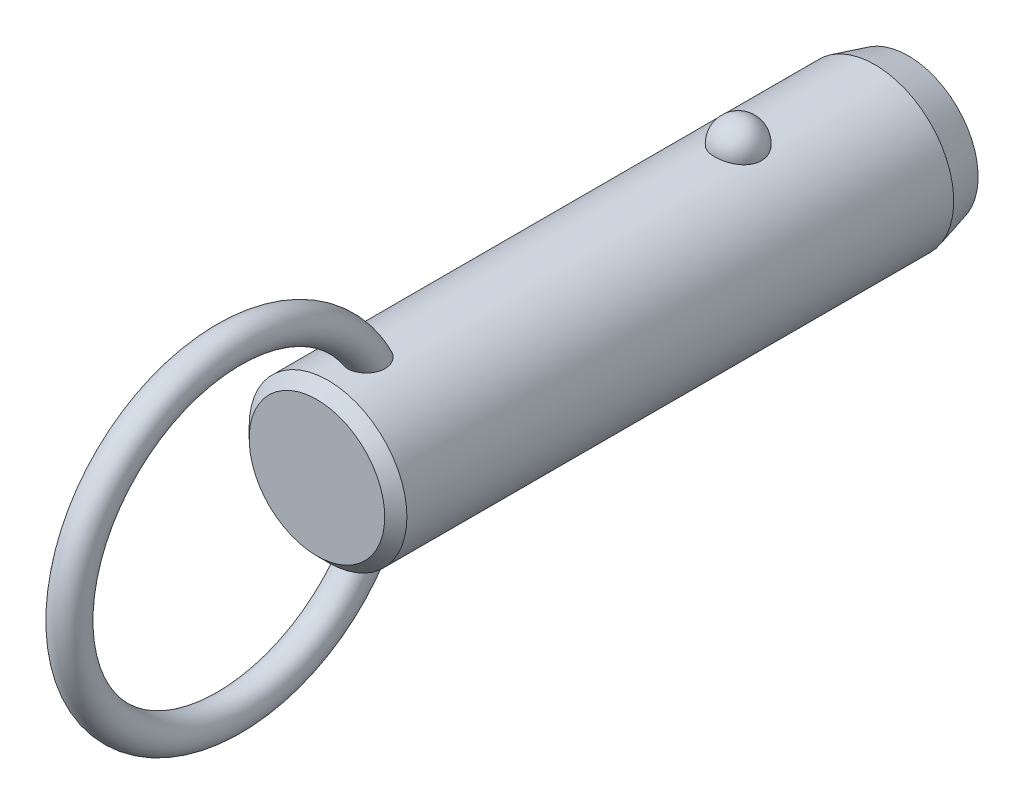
ISO-10303-21;
HEADER;
FILE_DESCRIPTION(('STEP AP214'),'2;1');
FILE_NAME('part.step','',(''),(''),'','','');
FILE_SCHEMA(('AUTOMOTIVE_DESIGN { 1 0 10303 214 1 1 1 1 }'));
ENDSEC;
DATA;
#1=APPLICATION_CONTEXT('core data for automotive mechanical design processes');
#2=APPLICATION_PROTOCOL_DEFINITION('international standard','automotive_design',2000,#1);
#3=PRODUCT_CONTEXT('',#1,'mechanical');
#4=PRODUCT('Part','Part','',(#3));
#5=PRODUCT_RELATED_PRODUCT_CATEGORY('part','',(#4));
#6=PRODUCT_DEFINITION_FORMATION('','',#4);
#7=PRODUCT_DEFINITION_CONTEXT('part definition',#1,'design');
#8=PRODUCT_DEFINITION('design','',#6,#7);
#9=PRODUCT_DEFINITION_SHAPE('','',#8);
#10=(LENGTH_UNIT() NAMED_UNIT(*) SI_UNIT(.MILLI.,.METRE.));
#11=(NAMED_UNIT(*) PLANE_ANGLE_UNIT() SI_UNIT($,.RADIAN.));
#12=(NAMED_UNIT(*) SI_UNIT($,.STERADIAN.) SOLID_ANGLE_UNIT());
#13=UNCERTAINTY_MEASURE_WITH_UNIT(LENGTH_MEASURE(1.E-05),#10,'distance_accuracy_value','');
#14=(GEOMETRIC_REPRESENTATION_CONTEXT(3) GLOBAL_UNCERTAINTY_ASSIGNED_CONTEXT((#13)) GLOBAL_UNIT_ASSIGNED_CONTEXT((#10,
#11,#12)) REPRESENTATION_CONTEXT('',''));
#15=CARTESIAN_POINT('',(0.,0.,0.));
#16=DIRECTION('',(0.,0.,1.));
#17=DIRECTION('',(1.,0.,0.));
#18=AXIS2_PLACEMENT_3D('',#15,#16,#17);
#19=CARTESIAN_POINT('',(0.,0.,27.9));
#20=DIRECTION('',(0.,0.,-1.));
#21=DIRECTION('',(-1.,0.,0.));
#22=AXIS2_PLACEMENT_3D('',#19,#20,#21);
#23=CYLINDRICAL_SURFACE('',#22,7.1);
#24=CARTESIAN_POINT('',(2.0769088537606,6.78943661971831,-2.1));
#25=CARTESIAN_POINT('',(2.07690739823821,6.78943796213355,-1.98268154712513));
#26=CARTESIAN_POINT('',(2.06738130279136,6.79237331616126,-1.86534506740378));
#27=CARTESIAN_POINT('',(2.0295040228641,6.8037853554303,-1.63400788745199));
#28=CARTESIAN_POINT('',(2.00114757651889,6.81226358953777,-1.52000812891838));
#29=CARTESIAN_POINT('',(1.92632025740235,6.83379798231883,-1.29863433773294));
#30=CARTESIAN_POINT('',(1.87985726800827,6.84685214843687,-1.19125744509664));
#31=CARTESIAN_POINT('',(1.76995205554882,6.87608091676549,-0.98604657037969));
#32=CARTESIAN_POINT('',(1.70650980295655,6.8922555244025,-0.88821260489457));
#33=CARTESIAN_POINT('',(1.5638119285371,6.92602930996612,-0.704242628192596));
#34=CARTESIAN_POINT('',(1.4844714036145,6.94363582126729,-0.618173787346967));
#35=CARTESIAN_POINT('',(1.31221746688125,6.97823658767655,-0.460740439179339));
#36=CARTESIAN_POINT('',(1.21930409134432,6.99523084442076,-0.389375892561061));
#37=CARTESIAN_POINT('',(1.02268781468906,7.02666176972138,-0.263547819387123));
#38=CARTESIAN_POINT('',(0.91902009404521,7.04110638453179,-0.209031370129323));
#39=CARTESIAN_POINT('',(0.703548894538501,7.06588726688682,-0.118163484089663));
#40=CARTESIAN_POINT('',(0.591746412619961,7.07622403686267,-0.0818098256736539));
#41=CARTESIAN_POINT('',(0.365557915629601,7.09147068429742,-0.0288711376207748));
#42=CARTESIAN_POINT('',(0.251267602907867,7.09648447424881,-0.0119070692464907));
#43=CARTESIAN_POINT('',(0.0213499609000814,7.10089837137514,0.00304925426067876));
#44=CARTESIAN_POINT('',(-0.0942772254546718,7.10029907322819,0.00104351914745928));
#45=CARTESIAN_POINT('',(-0.321651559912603,7.09360829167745,-0.0216931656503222));
#46=CARTESIAN_POINT('',(-0.433431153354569,7.08760388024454,-0.0421272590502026));
#47=CARTESIAN_POINT('',(-0.651862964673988,7.07086131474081,-0.100729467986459));
#48=CARTESIAN_POINT('',(-0.758515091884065,7.06012307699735,-0.138897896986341));
#49=CARTESIAN_POINT('',(-0.964449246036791,7.03496097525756,-0.232213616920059));
#50=CARTESIAN_POINT('',(-1.06368095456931,7.02051445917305,-0.287465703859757));
#51=CARTESIAN_POINT('',(-1.25145353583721,6.98948740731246,-0.413383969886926));
#52=CARTESIAN_POINT('',(-1.33999321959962,6.97290663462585,-0.48405186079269));
#53=CARTESIAN_POINT('',(-1.50591604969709,6.93898770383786,-0.640594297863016));
#54=CARTESIAN_POINT('',(-1.58302488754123,6.92164094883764,-0.726757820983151));
#55=CARTESIAN_POINT('',(-1.72189320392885,6.8884103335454,-0.91092752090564));
#56=CARTESIAN_POINT('',(-1.78365144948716,6.87252659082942,-1.008934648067));
#57=CARTESIAN_POINT('',(-1.89101272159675,6.84377189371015,-1.21549497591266));
#58=CARTESIAN_POINT('',(-1.93639553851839,6.83094274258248,-1.32416860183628));
#59=CARTESIAN_POINT('',(-2.00874275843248,6.81002070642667,-1.54791500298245));
#60=CARTESIAN_POINT('',(-2.03570774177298,6.80192767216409,-1.66298757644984));
#61=CARTESIAN_POINT('',(-2.07047276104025,6.7914266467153,-1.89571453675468));
#62=CARTESIAN_POINT('',(-2.07835878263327,6.78899315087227,-2.01335491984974));
#63=CARTESIAN_POINT('',(-2.07502083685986,6.79001409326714,-2.24833570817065));
#64=CARTESIAN_POINT('',(-2.06379746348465,6.7934683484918,-2.36567612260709));
#65=CARTESIAN_POINT('',(-2.02263913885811,6.80583442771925,-2.59603194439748));
#66=CARTESIAN_POINT('',(-1.99281127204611,6.81471501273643,-2.70906820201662));
#67=CARTESIAN_POINT('',(-1.91526639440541,6.83691232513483,-2.92836575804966));
#68=CARTESIAN_POINT('',(-1.8675486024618,6.85022924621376,-3.03462676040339));
#69=CARTESIAN_POINT('',(-1.75504492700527,6.87991336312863,-3.23806487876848));
#70=CARTESIAN_POINT('',(-1.69015924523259,6.89629822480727,-3.33518422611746));
#71=CARTESIAN_POINT('',(-1.54505404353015,6.93024852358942,-3.51697105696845));
#72=CARTESIAN_POINT('',(-1.46483385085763,6.94781401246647,-3.60163799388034));
#73=CARTESIAN_POINT('',(-1.29071406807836,6.98225977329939,-3.75654119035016));
#74=CARTESIAN_POINT('',(-1.19675650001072,6.99913673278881,-3.82671308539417));
#75=CARTESIAN_POINT('',(-0.997940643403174,7.03023618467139,-3.9501837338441));
#76=CARTESIAN_POINT('',(-0.89308318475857,7.04445887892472,-4.00348377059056));
#77=CARTESIAN_POINT('',(-0.676902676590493,7.06848365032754,-4.09107242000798));
#78=CARTESIAN_POINT('',(-0.565686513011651,7.0783430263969,-4.12560889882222));
#79=CARTESIAN_POINT('',(-0.338739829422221,7.09282534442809,-4.17575450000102));
#80=CARTESIAN_POINT('',(-0.223009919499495,7.09744899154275,-4.19136617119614));
#81=CARTESIAN_POINT('',(0.00707628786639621,7.10090930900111,-4.20307965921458));
#82=CARTESIAN_POINT('',(0.121410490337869,7.09986531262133,-4.19958377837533));
#83=CARTESIAN_POINT('',(0.347815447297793,7.092380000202,-4.17411564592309));
#84=CARTESIAN_POINT('',(0.459886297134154,7.08593891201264,-4.15214417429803));
#85=CARTESIAN_POINT('',(0.678084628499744,7.06838983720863,-4.09049562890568));
#86=CARTESIAN_POINT('',(0.784237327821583,7.05730369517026,-4.05090137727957));
#87=CARTESIAN_POINT('',(0.988305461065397,7.03163139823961,-3.95511447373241));
#88=CARTESIAN_POINT('',(1.08622031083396,7.01704499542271,-3.89892064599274));
#89=CARTESIAN_POINT('',(1.27284490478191,6.98562668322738,-3.77035541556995));
#90=CARTESIAN_POINT('',(1.36137372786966,6.96876135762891,-3.69772964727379));
#91=CARTESIAN_POINT('',(1.52509486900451,6.93477412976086,-3.53878279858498));
#92=CARTESIAN_POINT('',(1.60028496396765,6.91765218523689,-3.45245943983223));
#93=CARTESIAN_POINT('',(1.73681688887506,6.88465753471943,-3.26658774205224));
#94=CARTESIAN_POINT('',(1.79785966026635,6.86881574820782,-3.16681408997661));
#95=CARTESIAN_POINT('',(1.90265327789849,6.84053157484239,-2.95814408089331));
#96=CARTESIAN_POINT('',(1.94640861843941,6.82808830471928,-2.84925010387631));
#97=CARTESIAN_POINT('',(2.01274378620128,6.80881460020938,-2.63454318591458));
#98=CARTESIAN_POINT('',(2.03676193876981,6.80160856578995,-2.52920574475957));
#99=CARTESIAN_POINT('',(2.06884490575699,6.79191902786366,-2.3159172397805));
#100=CARTESIAN_POINT('',(2.07691019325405,6.78943538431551,-2.20796625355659));
#101=CARTESIAN_POINT('',(2.0769088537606,6.78943661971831,-2.1));
#102=B_SPLINE_CURVE_WITH_KNOTS('',3,(#24,#25,#26,#27,#28,#29,#30,#31,#32,#33,#34,#35,#36,#37,
#38,#39,#40,#41,#42,#43,#44,#45,#46,#47,#48,#49,#50,#51,#52,#53,#54,#55,#56,#57,#58,#59,#60,#61,
#62,#63,#64,#65,#66,#67,#68,#69,#70,#71,#72,#73,#74,#75,#76,#77,#78,#79,#80,#81,#82,#83,#84,#85,
#86,#87,#88,#89,#90,#91,#92,#93,#94,#95,#96,#97,#98,#99,#100,#101),.UNSPECIFIED.,.T.,.F.,(4,2,2,
2,2,2,2,2,2,2,2,2,2,2,2,2,2,2,2,2,2,2,2,2,2,2,2,2,2,2,2,2,2,2,2,2,2,2,4),(0.,0.351568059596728,
0.703234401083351,1.05474780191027,1.40626181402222,1.75970563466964,2.11314851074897,
2.4654696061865,2.81774759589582,3.16301449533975,3.50824481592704,3.84801136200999,
4.18778391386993,4.52968352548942,4.87162112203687,5.22076181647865,5.56993054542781,
5.92363364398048,6.27732559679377,6.62942052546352,6.98150450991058,7.33158042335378,
7.68167162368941,8.03384443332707,8.38603269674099,8.73975272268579,9.09344583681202,
9.44234545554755,9.79119807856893,10.1327344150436,10.4742563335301,10.8141898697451,
11.1541474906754,11.4997793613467,11.8454687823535,12.1979079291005,12.5502553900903,
12.8738073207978,13.1973496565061),.UNSPECIFIED.);
#103=CARTESIAN_POINT('',(2.0769088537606,6.78943661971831,-2.1));
#104=VERTEX_POINT('',#103);
#105=EDGE_CURVE('E41',#104,#104,#102,.T.);
#106=ORIENTED_EDGE('',*,*,#105,.T.);
#107=EDGE_LOOP('',(#106));
#108=FACE_BOUND('',#107,.T.);
#109=CARTESIAN_POINT('',(0.,0.,34.82));
#110=DIRECTION('',(0.,0.,1.));
#111=DIRECTION('',(1.,0.,0.));
#112=AXIS2_PLACEMENT_3D('',#109,#110,#111);
#113=CIRCLE('',#112,7.1);
#114=CARTESIAN_POINT('',(7.1,0.,34.82));
#115=VERTEX_POINT('',#114);
#116=EDGE_CURVE('E10',#115,#115,#113,.F.);
#117=ORIENTED_EDGE('',*,*,#116,.T.);
#118=EDGE_LOOP('',(#117));
#119=FACE_BOUND('',#118,.T.);
#120=CARTESIAN_POINT('',(-0.429539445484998,-7.08699541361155,29.6429212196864));
#121=CARTESIAN_POINT('',(-0.50833166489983,-7.08221999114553,29.6668764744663));
#122=CARTESIAN_POINT('',(-0.585039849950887,-7.07624016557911,29.6974570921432));
#123=CARTESIAN_POINT('',(-0.73208265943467,-7.06254296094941,29.7710242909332));
#124=CARTESIAN_POINT('',(-0.802417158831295,-7.05482554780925,29.8140111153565));
#125=CARTESIAN_POINT('',(-0.93472277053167,-7.03851844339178,29.9111135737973));
#126=CARTESIAN_POINT('',(-0.996700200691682,-7.02992941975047,29.9652207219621));
#127=CARTESIAN_POINT('',(-1.11079942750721,-7.01280697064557,30.0829676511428));
#128=CARTESIAN_POINT('',(-1.16292136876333,-7.00427354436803,30.1466072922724));
#129=CARTESIAN_POINT('',(-1.25705660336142,-6.98799959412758,30.2826870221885));
#130=CARTESIAN_POINT('',(-1.29888032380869,-6.98027525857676,30.3552598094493));
#131=CARTESIAN_POINT('',(-1.37069920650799,-6.96652886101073,30.5061686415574));
#132=CARTESIAN_POINT('',(-1.40069157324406,-6.96050720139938,30.5845060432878));
#133=CARTESIAN_POINT('',(-1.45043507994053,-6.95031881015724,30.7501903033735));
#134=CARTESIAN_POINT('',(-1.46937115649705,-6.94630231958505,30.8377897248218));
#135=CARTESIAN_POINT('',(-1.49424917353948,-6.94099239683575,31.0148714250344));
#136=CARTESIAN_POINT('',(-1.50018601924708,-6.93970003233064,31.1043544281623));
#137=CARTESIAN_POINT('',(-1.49978214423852,-6.93978815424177,31.2940607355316));
#138=CARTESIAN_POINT('',(-1.49187639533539,-6.94150934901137,31.394279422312));
#139=CARTESIAN_POINT('',(-1.46177925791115,-6.94790814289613,31.5924798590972));
#140=CARTESIAN_POINT('',(-1.43957541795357,-6.95258831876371,31.690459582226));
#141=CARTESIAN_POINT('',(-1.37783293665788,-6.96510647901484,31.8953629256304));
#142=CARTESIAN_POINT('',(-1.33634073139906,-6.97328848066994,32.0016801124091));
#143=CARTESIAN_POINT('',(-1.23686994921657,-6.99161706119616,32.2061777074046));
#144=CARTESIAN_POINT('',(-1.17889192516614,-7.00176357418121,32.3043583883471));
#145=CARTESIAN_POINT('',(-1.0587512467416,-7.02082898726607,32.4723743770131));
#146=CARTESIAN_POINT('',(-0.999247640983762,-7.02963746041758,32.5441230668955));
#147=CARTESIAN_POINT('',(-0.869494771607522,-7.04686074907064,32.6771959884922));
#148=CARTESIAN_POINT('',(-0.799263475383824,-7.05527619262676,32.7385372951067));
#149=CARTESIAN_POINT('',(-0.665408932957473,-7.06899457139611,32.8351316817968));
#150=CARTESIAN_POINT('',(-0.60381789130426,-7.07457275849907,32.8731512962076));
#151=CARTESIAN_POINT('',(-0.475172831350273,-7.08437420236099,32.9387581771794));
#152=CARTESIAN_POINT('',(-0.408123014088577,-7.08859848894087,32.9663533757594));
#153=CARTESIAN_POINT('',(-0.269431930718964,-7.09522749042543,33.0092569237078));
#154=CARTESIAN_POINT('',(-0.197757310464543,-7.09761688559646,33.0244618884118));
#155=CARTESIAN_POINT('',(-0.0527849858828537,-7.10017268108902,33.0407168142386));
#156=CARTESIAN_POINT('',(0.0205115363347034,-7.10034065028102,33.0417767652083));
#157=CARTESIAN_POINT('',(0.156426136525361,-7.09855986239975,33.0304619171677));
#158=CARTESIAN_POINT('',(0.219199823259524,-7.09688191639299,33.0198060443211));
#159=CARTESIAN_POINT('',(0.342134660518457,-7.09201880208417,32.9885379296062));
#160=CARTESIAN_POINT('',(0.402295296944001,-7.08883333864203,32.9679237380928));
#161=CARTESIAN_POINT('',(0.520687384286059,-7.08113868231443,32.9172125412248));
#162=CARTESIAN_POINT('',(0.578791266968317,-7.07658958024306,32.8868272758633));
#163=CARTESIAN_POINT('',(0.6901732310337,-7.06659708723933,32.8183678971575));
#164=CARTESIAN_POINT('',(0.743447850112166,-7.061153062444,32.7802883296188));
#165=CARTESIAN_POINT('',(0.870947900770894,-7.04680292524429,32.6765929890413));
#166=CARTESIAN_POINT('',(0.94182890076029,-7.0375580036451,32.6068972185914));
#167=CARTESIAN_POINT('',(1.07136606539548,-7.01900793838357,32.4569450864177));
#168=CARTESIAN_POINT('',(1.13000013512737,-7.00970271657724,32.3766700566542));
#169=CARTESIAN_POINT('',(1.23579584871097,-6.99183327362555,32.2068997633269));
#170=CARTESIAN_POINT('',(1.28274271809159,-6.98328455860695,32.1172696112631));
#171=CARTESIAN_POINT('',(1.36351442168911,-6.96796352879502,31.9321763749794));
#172=CARTESIAN_POINT('',(1.39733971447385,-6.96119115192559,31.8367134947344));
#173=CARTESIAN_POINT('',(1.45579181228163,-6.94922464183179,31.6253092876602));
#174=CARTESIAN_POINT('',(1.47790145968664,-6.94449000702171,31.508631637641));
#175=CARTESIAN_POINT('',(1.50168752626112,-6.93938731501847,31.2730153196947));
#176=CARTESIAN_POINT('',(1.50336085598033,-6.93901991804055,31.1540763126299));
#177=CARTESIAN_POINT('',(1.48486516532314,-6.9430010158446,30.9236079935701));
#178=CARTESIAN_POINT('',(1.46573441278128,-6.9471253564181,30.8119958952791));
#179=CARTESIAN_POINT('',(1.40606892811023,-6.95944667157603,30.5948868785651));
#180=CARTESIAN_POINT('',(1.3655644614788,-6.96763788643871,30.4893815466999));
#181=CARTESIAN_POINT('',(1.27082700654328,-6.98548038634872,30.3042879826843));
#182=CARTESIAN_POINT('',(1.21949810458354,-6.99473841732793,30.2231719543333));
#183=CARTESIAN_POINT('',(1.10242050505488,-7.01414069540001,30.0722278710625));
#184=CARTESIAN_POINT('',(1.03668119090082,-7.02428436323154,30.0023925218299));
#185=CARTESIAN_POINT('',(0.900559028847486,-7.04295285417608,29.8835735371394));
#186=CARTESIAN_POINT('',(0.831428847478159,-7.05153466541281,29.8331573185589));
#187=CARTESIAN_POINT('',(0.685291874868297,-7.06723150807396,29.7451429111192));
#188=CARTESIAN_POINT('',(0.608287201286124,-7.0743469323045,29.7075412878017));
#189=CARTESIAN_POINT('',(0.451878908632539,-7.08602232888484,29.6474915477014));
#190=CARTESIAN_POINT('',(0.372686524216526,-7.09067127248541,29.6245088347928));
#191=CARTESIAN_POINT('',(0.211477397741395,-7.09730788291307,29.5920357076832));
#192=CARTESIAN_POINT('',(0.129460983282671,-7.09929585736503,29.5825437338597));
#193=CARTESIAN_POINT('',(-0.0332905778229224,-7.10037858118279,29.5773517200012));
#194=CARTESIAN_POINT('',(-0.114016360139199,-7.09953334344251,29.5813656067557));
#195=CARTESIAN_POINT('',(-0.273670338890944,-7.09517338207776,29.6024540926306));
#196=CARTESIAN_POINT('',(-0.35259851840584,-7.09165863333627,29.6195288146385));
#197=CARTESIAN_POINT('',(-0.429539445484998,-7.08699541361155,29.6429212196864));
#198=B_SPLINE_CURVE_WITH_KNOTS('',3,(#120,#121,#122,#123,#124,#125,#126,#127,#128,#129,#130,
#131,#132,#133,#134,#135,#136,#137,#138,#139,#140,#141,#142,#143,#144,#145,#146,#147,#148,#149,
#150,#151,#152,#153,#154,#155,#156,#157,#158,#159,#160,#161,#162,#163,#164,#165,#166,#167,#168,
#169,#170,#171,#172,#173,#174,#175,#176,#177,#178,#179,#180,#181,#182,#183,#184,#185,#186,#187,
#188,#189,#190,#191,#192,#193,#194,#195,#196,#197),.UNSPECIFIED.,.T.,.F.,(4,2,2,2,2,2,2,2,2,2,2,
2,2,2,2,2,2,2,2,2,2,2,2,2,2,2,2,2,2,2,2,2,2,2,2,2,2,2,4),(0.,0.247183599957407,
0.494372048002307,0.741372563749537,0.988369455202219,1.23962059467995,1.49093106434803,
1.75897818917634,2.02713035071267,2.32758265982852,2.62829697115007,2.97008736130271,
3.31186629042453,3.59175319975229,3.87117637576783,4.08813841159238,4.30493502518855,
4.52352259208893,4.74195577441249,4.93215328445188,5.12238804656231,5.31884850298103,
5.51544871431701,5.81332317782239,6.11173048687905,6.41527266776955,6.71880423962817,
7.07358156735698,7.42841252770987,7.7663148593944,8.10373999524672,8.39142246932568,
8.67891817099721,8.93560332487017,9.19221962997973,9.43881106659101,9.68537399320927,
9.92674752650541,10.1681233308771),.UNSPECIFIED.);
#199=CARTESIAN_POINT('',(-0.429539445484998,-7.08699541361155,29.6429212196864));
#200=VERTEX_POINT('',#199);
#201=EDGE_CURVE('E60',#200,#200,#198,.T.);
#202=ORIENTED_EDGE('',*,*,#201,.T.);
#203=EDGE_LOOP('',(#202));
#204=FACE_BOUND('',#203,.T.);
#205=CARTESIAN_POINT('',(-0.429539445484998,7.08699541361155,29.6429212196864));
#206=CARTESIAN_POINT('',(-0.35166550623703,7.09171429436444,29.6192469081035));
#207=CARTESIAN_POINT('',(-0.271733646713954,7.09525896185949,29.6020369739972));
#208=CARTESIAN_POINT('',(-0.110026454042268,7.09960839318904,29.5810059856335));
#209=CARTESIAN_POINT('',(-0.0282502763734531,7.10041187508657,29.577191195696));
#210=CARTESIAN_POINT('',(0.134782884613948,7.09918849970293,29.583059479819));
#211=CARTESIAN_POINT('',(0.216039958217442,7.09716214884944,29.5927401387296));
#212=CARTESIAN_POINT('',(0.37573056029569,7.09050177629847,29.6253471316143));
#213=CARTESIAN_POINT('',(0.454164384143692,7.08586802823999,29.6482720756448));
#214=CARTESIAN_POINT('',(0.606025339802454,7.07449911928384,29.706771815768));
#215=CARTESIAN_POINT('',(0.679451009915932,7.06776334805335,29.7423502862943));
#216=CARTESIAN_POINT('',(0.819234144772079,7.05292866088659,29.8251753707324));
#217=CARTESIAN_POINT('',(0.885591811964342,7.04482978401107,29.8724216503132));
#218=CARTESIAN_POINT('',(1.00993211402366,7.02808709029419,29.9775902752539));
#219=CARTESIAN_POINT('',(1.06785399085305,7.01943990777,30.035583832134));
#220=CARTESIAN_POINT('',(1.17342527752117,7.00256662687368,30.1603013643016));
#221=CARTESIAN_POINT('',(1.22107408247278,6.99434055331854,30.2270258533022));
#222=CARTESIAN_POINT('',(1.30652927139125,6.97889183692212,30.3693622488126));
#223=CARTESIAN_POINT('',(1.34399711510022,6.97170674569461,30.4451808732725));
#224=CARTESIAN_POINT('',(1.40682616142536,6.95930080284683,30.6018100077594));
#225=CARTESIAN_POINT('',(1.43218374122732,6.95408053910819,30.6826220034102));
#226=CARTESIAN_POINT('',(1.47246409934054,6.94566853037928,30.8535314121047));
#227=CARTESIAN_POINT('',(1.48642590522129,6.9426653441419,30.9438630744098));
#228=CARTESIAN_POINT('',(1.5011410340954,6.93949744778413,31.125619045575));
#229=CARTESIAN_POINT('',(1.50188917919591,6.93933385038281,31.2170437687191));
#230=CARTESIAN_POINT('',(1.49030464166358,6.94183245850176,31.4108438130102));
#231=CARTESIAN_POINT('',(1.47627413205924,6.94486147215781,31.513112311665));
#232=CARTESIAN_POINT('',(1.43356351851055,6.95380194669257,31.7144719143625));
#233=CARTESIAN_POINT('',(1.4048676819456,6.95971650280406,31.8135594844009));
#234=CARTESIAN_POINT('',(1.32908750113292,6.97461208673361,32.0189087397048));
#235=CARTESIAN_POINT('',(1.28011435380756,6.98388945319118,32.1244566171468));
#236=CARTESIAN_POINT('',(1.16520357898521,7.00397743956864,32.3257604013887));
#237=CARTESIAN_POINT('',(1.09927694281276,7.01478706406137,32.4215225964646));
#238=CARTESIAN_POINT('',(0.969361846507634,7.03373936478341,32.5767565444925));
#239=CARTESIAN_POINT('',(0.909042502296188,7.04187023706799,32.6393032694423));
#240=CARTESIAN_POINT('',(0.779178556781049,7.05741732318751,32.7540535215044));
#241=CARTESIAN_POINT('',(0.709649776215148,7.06483472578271,32.8062744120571));
#242=CARTESIAN_POINT('',(0.576854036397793,7.0767751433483,32.8881138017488));
#243=CARTESIAN_POINT('',(0.515118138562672,7.08158033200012,32.9201641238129));
#244=CARTESIAN_POINT('',(0.387127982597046,7.08972701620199,32.9737656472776));
#245=CARTESIAN_POINT('',(0.32087720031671,7.09306962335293,32.9953248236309));
#246=CARTESIAN_POINT('',(0.185041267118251,7.09791507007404,33.0264005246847));
#247=CARTESIAN_POINT('',(0.115437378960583,7.09940591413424,33.0358385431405));
#248=CARTESIAN_POINT('',(-0.0243157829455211,7.10030171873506,33.0415226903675));
#249=CARTESIAN_POINT('',(-0.0944648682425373,7.0997073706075,33.0377731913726));
#250=CARTESIAN_POINT('',(-0.225713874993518,7.09668414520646,33.0185081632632));
#251=CARTESIAN_POINT('',(-0.287006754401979,7.09444865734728,33.0042323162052));
#252=CARTESIAN_POINT('',(-0.406555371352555,7.08860360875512,32.9663685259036));
#253=CARTESIAN_POINT('',(-0.464809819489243,7.08499346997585,32.9427766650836));
#254=CARTESIAN_POINT('',(-0.594955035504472,7.07541654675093,32.8789232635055));
#255=CARTESIAN_POINT('',(-0.665389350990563,7.06906574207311,32.835753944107));
#256=CARTESIAN_POINT('',(-0.798242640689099,7.05530261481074,32.738587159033));
#257=CARTESIAN_POINT('',(-0.860645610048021,7.0478882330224,32.6845686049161));
#258=CARTESIAN_POINT('',(-0.994249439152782,7.03045217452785,32.5509965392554));
#259=CARTESIAN_POINT('',(-1.06260129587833,7.02030745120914,32.4686143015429));
#260=CARTESIAN_POINT('',(-1.18502045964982,7.00068382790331,32.293843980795));
#261=CARTESIAN_POINT('',(-1.239076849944,6.99120544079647,32.201448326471));
#262=CARTESIAN_POINT('',(-1.33335589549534,6.97384343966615,32.0080085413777));
#263=CARTESIAN_POINT('',(-1.3733613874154,6.96598557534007,31.9068564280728));
#264=CARTESIAN_POINT('',(-1.43770677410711,6.9529905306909,31.6995046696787));
#265=CARTESIAN_POINT('',(-1.46204473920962,6.94785368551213,31.59330440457));
#266=CARTESIAN_POINT('',(-1.49537533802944,6.94076296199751,31.368231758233));
#267=CARTESIAN_POINT('',(-1.50273564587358,6.93914842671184,31.2490975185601));
#268=CARTESIAN_POINT('',(-1.4954555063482,6.94072368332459,31.0114703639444));
#269=CARTESIAN_POINT('',(-1.48082914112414,6.94391040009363,30.8929770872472));
#270=CARTESIAN_POINT('',(-1.43076401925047,6.95438579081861,30.6734325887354));
#271=CARTESIAN_POINT('',(-1.39762227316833,6.96121852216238,30.5718413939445));
#272=CARTESIAN_POINT('',(-1.31211274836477,6.97783941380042,30.3773513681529));
#273=CARTESIAN_POINT('',(-1.25976607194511,6.98762432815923,30.2844431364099));
#274=CARTESIAN_POINT('',(-1.14583073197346,7.00713153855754,30.1241601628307));
#275=CARTESIAN_POINT('',(-1.0866594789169,7.01665982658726,30.0550351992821));
#276=CARTESIAN_POINT('',(-0.956606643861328,7.03556646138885,29.9288786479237));
#277=CARTESIAN_POINT('',(-0.885737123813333,7.04494495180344,29.8718347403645));
#278=CARTESIAN_POINT('',(-0.751558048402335,7.06035735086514,29.7831004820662));
#279=CARTESIAN_POINT('',(-0.690120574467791,7.0666695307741,29.7485932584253));
#280=CARTESIAN_POINT('',(-0.562815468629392,7.07794609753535,29.6887507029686));
#281=CARTESIAN_POINT('',(-0.496948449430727,7.08291067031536,29.6634141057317));
#282=CARTESIAN_POINT('',(-0.429539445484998,7.08699541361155,29.6429212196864));
#283=B_SPLINE_CURVE_WITH_KNOTS('',3,(#205,#206,#207,#208,#209,#210,#211,#212,#213,#214,#215,
#216,#217,#218,#219,#220,#221,#222,#223,#224,#225,#226,#227,#228,#229,#230,#231,#232,#233,#234,
#235,#236,#237,#238,#239,#240,#241,#242,#243,#244,#245,#246,#247,#248,#249,#250,#251,#252,#253,
#254,#255,#256,#257,#258,#259,#260,#261,#262,#263,#264,#265,#266,#267,#268,#269,#270,#271,#272,
#273,#274,#275,#276,#277,#278,#279,#280,#281,#282),.UNSPECIFIED.,.T.,.F.,(4,2,2,2,2,2,2,2,2,2,2,
2,2,2,2,2,2,2,2,2,2,2,2,2,2,2,2,2,2,2,2,2,2,2,2,2,2,2,4),(0.,0.244335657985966,
0.488785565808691,0.733191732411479,0.977572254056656,1.22202379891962,1.46646834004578,
1.71259457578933,1.9587352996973,2.21226768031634,2.46587585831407,2.73913816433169,
3.01250754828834,3.32109936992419,3.63002293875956,3.9786351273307,4.32702187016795,
4.58793945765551,4.84841449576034,5.05676704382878,5.26496096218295,5.47449661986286,
5.68396281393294,5.87205447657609,6.06022532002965,6.30743751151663,6.55513496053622,
6.87602468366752,7.19715875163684,7.52305774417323,7.84899686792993,8.20516155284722,
8.56109821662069,8.88040084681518,9.19935367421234,9.47236282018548,9.7450922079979,
9.95662250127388,10.1681235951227),.UNSPECIFIED.);
#284=CARTESIAN_POINT('',(-0.429539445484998,7.08699541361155,29.6429212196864));
#285=VERTEX_POINT('',#284);
#286=EDGE_CURVE('E67',#285,#285,#283,.T.);
#287=ORIENTED_EDGE('',*,*,#286,.T.);
#288=EDGE_LOOP('',(#287));
#289=FACE_BOUND('',#288,.T.);
#290=CARTESIAN_POINT('',(0.,0.,-14.3999999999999));
#291=DIRECTION('',(0.,0.,-1.));
#292=DIRECTION('',(-1.,0.,0.));
#293=AXIS2_PLACEMENT_3D('',#290,#291,#292);
#294=CIRCLE('',#293,7.1);
#295=CARTESIAN_POINT('',(-7.1,0.,-14.3999999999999));
#296=VERTEX_POINT('',#295);
#297=EDGE_CURVE('E57',#296,#296,#294,.F.);
#298=ORIENTED_EDGE('',*,*,#297,.T.);
#299=EDGE_LOOP('',(#298));
#300=FACE_BOUND('',#299,.T.);
#301=ADVANCED_FACE('F37',(#108,#119,#204,#289,#300),#23,.T.);
#302=CARTESIAN_POINT('',(0.,0.,-17.4));
#303=DIRECTION('',(0.,0.,-1.));
#304=DIRECTION('',(-1.,0.,0.));
#305=AXIS2_PLACEMENT_3D('',#302,#303,#304);
#306=PLANE('',#305);
#307=CARTESIAN_POINT('',(0.,0.,-17.4));
#308=DIRECTION('',(0.,0.,-1.));
#309=DIRECTION('',(-1.,0.,0.));
#310=AXIS2_PLACEMENT_3D('',#307,#308,#309);
#311=CIRCLE('',#310,6.29615242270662);
#312=CARTESIAN_POINT('',(-6.29615242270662,0.,-17.4));
#313=VERTEX_POINT('',#312);
#314=EDGE_CURVE('E66',#313,#313,#311,.T.);
#315=ORIENTED_EDGE('',*,*,#314,.T.);
#316=EDGE_LOOP('',(#315));
#317=FACE_BOUND('',#316,.T.);
#318=ADVANCED_FACE('F85',(#317),#306,.T.);
#319=CARTESIAN_POINT('',(0.,0.,-17.4));
#320=DIRECTION('',(0.,0.,1.));
#321=DIRECTION('',(1.,0.,0.));
#322=AXIS2_PLACEMENT_3D('',#319,#320,#321);
#323=CONICAL_SURFACE('',#322,6.29615242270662,0.261799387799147);
#324=ORIENTED_EDGE('',*,*,#297,.F.);
#325=EDGE_LOOP('',(#324));
#326=FACE_BOUND('',#325,.T.);
#327=ORIENTED_EDGE('',*,*,#314,.F.);
#328=EDGE_LOOP('',(#327));
#329=FACE_BOUND('',#328,.T.);
#330=ADVANCED_FACE('F83',(#326,#329),#323,.T.);
#331=CARTESIAN_POINT('',(0.,0.,35.82));
#332=DIRECTION('',(0.,0.,1.));
#333=DIRECTION('',(1.,0.,0.));
#334=AXIS2_PLACEMENT_3D('',#331,#332,#333);
#335=PLANE('',#334);
#336=CARTESIAN_POINT('',(0.,0.,35.82));
#337=DIRECTION('',(0.,0.,1.));
#338=DIRECTION('',(1.,0.,0.));
#339=AXIS2_PLACEMENT_3D('',#336,#337,#338);
#340=CIRCLE('',#339,6.1);
#341=CARTESIAN_POINT('',(6.1,0.,35.82));
#342=VERTEX_POINT('',#341);
#343=EDGE_CURVE('E50',#342,#342,#340,.T.);
#344=ORIENTED_EDGE('',*,*,#343,.T.);
#345=EDGE_LOOP('',(#344));
#346=FACE_BOUND('',#345,.T.);
#347=ADVANCED_FACE('F77',(#346),#335,.T.);
#348=CARTESIAN_POINT('',(0.,0.,43.75));
#349=DIRECTION('',(1.,0.,0.));
#350=DIRECTION('',(0.,0.,-1.));
#351=AXIS2_PLACEMENT_3D('',#348,#349,#350);
#352=TOROIDAL_SURFACE('',#351,14.35,1.5);
#353=ORIENTED_EDGE('',*,*,#286,.F.);
#354=EDGE_LOOP('',(#353));
#355=FACE_BOUND('',#354,.T.);
#356=ORIENTED_EDGE('',*,*,#201,.F.);
#357=EDGE_LOOP('',(#356));
#358=FACE_BOUND('',#357,.T.);
#359=ADVANCED_FACE('F73',(#355,#358),#352,.T.);
#360=CARTESIAN_POINT('',(0.,0.,35.82));
#361=DIRECTION('',(0.,0.,-1.));
#362=DIRECTION('',(-1.,0.,0.));
#363=AXIS2_PLACEMENT_3D('',#360,#361,#362);
#364=CONICAL_SURFACE('',#363,6.1,0.78539816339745);
#365=ORIENTED_EDGE('',*,*,#116,.F.);
#366=EDGE_LOOP('',(#365));
#367=FACE_BOUND('',#366,.T.);
#368=ORIENTED_EDGE('',*,*,#343,.F.);
#369=EDGE_LOOP('',(#368));
#370=FACE_BOUND('',#369,.T.);
#371=ADVANCED_FACE('F39',(#367,#370),#364,.T.);
#372=CARTESIAN_POINT('',(0.,7.1,-2.1));
#373=DIRECTION('',(0.,1.,0.));
#374=DIRECTION('',(0.,0.,1.));
#375=AXIS2_PLACEMENT_3D('',#372,#373,#374);
#376=SPHERICAL_SURFACE('',#375,2.10000000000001);
#377=ORIENTED_EDGE('',*,*,#105,.F.);
#378=EDGE_LOOP('',(#377));
#379=FACE_BOUND('',#378,.T.);
#380=ADVANCED_FACE('F79',(#379),#376,.T.);
#381=CLOSED_SHELL('',(#301,#318,#330,#347,#359,#371,#380));
#382=MANIFOLD_SOLID_BREP('B2',#381);
#383=ADVANCED_BREP_SHAPE_REPRESENTATION('',(#18,#382),#14);
#384=SHAPE_DEFINITION_REPRESENTATION(#9,#383);
ENDSEC;
END-ISO-10303-21;
